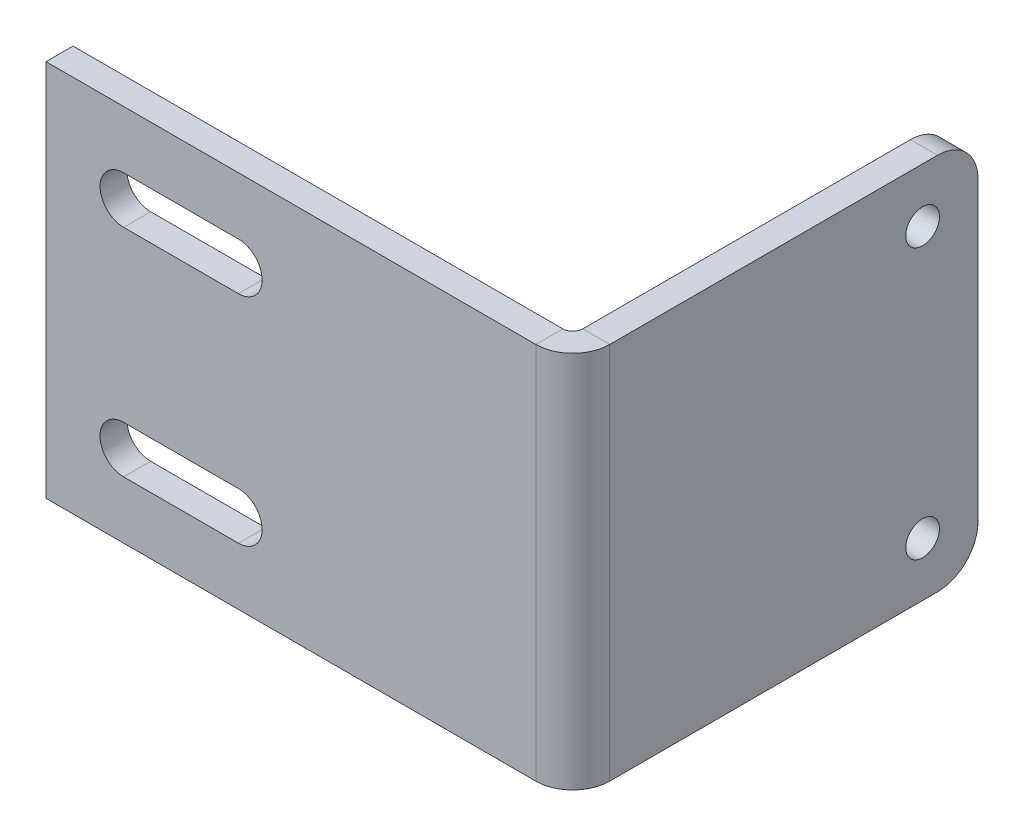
ISO-10303-21;
HEADER;
FILE_DESCRIPTION(('STEP AP214'),'2;1');
FILE_NAME('part.step','',(''),(''),'','','');
FILE_SCHEMA(('AUTOMOTIVE_DESIGN { 1 0 10303 214 1 1 1 1 }'));
ENDSEC;
DATA;
#1=APPLICATION_CONTEXT('core data for automotive mechanical design processes');
#2=APPLICATION_PROTOCOL_DEFINITION('international standard','automotive_design',2000,#1);
#3=PRODUCT_CONTEXT('',#1,'mechanical');
#4=PRODUCT('Part','Part','',(#3));
#5=PRODUCT_RELATED_PRODUCT_CATEGORY('part','',(#4));
#6=PRODUCT_DEFINITION_FORMATION('','',#4);
#7=PRODUCT_DEFINITION_CONTEXT('part definition',#1,'design');
#8=PRODUCT_DEFINITION('design','',#6,#7);
#9=PRODUCT_DEFINITION_SHAPE('','',#8);
#10=(LENGTH_UNIT() NAMED_UNIT(*) SI_UNIT(.MILLI.,.METRE.));
#11=(NAMED_UNIT(*) PLANE_ANGLE_UNIT() SI_UNIT($,.RADIAN.));
#12=(NAMED_UNIT(*) SI_UNIT($,.STERADIAN.) SOLID_ANGLE_UNIT());
#13=UNCERTAINTY_MEASURE_WITH_UNIT(LENGTH_MEASURE(1.E-05),#10,'distance_accuracy_value','');
#14=(GEOMETRIC_REPRESENTATION_CONTEXT(3) GLOBAL_UNCERTAINTY_ASSIGNED_CONTEXT((#13)) GLOBAL_UNIT_ASSIGNED_CONTEXT((#10,
#11,#12)) REPRESENTATION_CONTEXT('',''));
#15=CARTESIAN_POINT('',(0.,0.,0.));
#16=DIRECTION('',(0.,0.,1.));
#17=DIRECTION('',(1.,0.,0.));
#18=AXIS2_PLACEMENT_3D('',#15,#16,#17);
#19=CARTESIAN_POINT('',(0.,0.,2.));
#20=DIRECTION('',(0.,0.,1.));
#21=DIRECTION('',(1.,0.,0.));
#22=AXIS2_PLACEMENT_3D('',#19,#20,#21);
#23=PLANE('',#22);
#24=DIRECTION('',(1.,0.,0.));
#25=VECTOR('',#24,1.);
#26=CARTESIAN_POINT('',(-7.21644966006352E-13,-12.8221643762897,2.));
#27=LINE('',#26,#25);
#28=CARTESIAN_POINT('',(-7.21644966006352E-13,-12.8221643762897,2.));
#29=VERTEX_POINT('',#28);
#30=CARTESIAN_POINT('',(36.2633999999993,-12.8221643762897,2.));
#31=VERTEX_POINT('',#30);
#32=EDGE_CURVE('E255',#29,#31,#27,.T.);
#33=ORIENTED_EDGE('',*,*,#32,.T.);
#34=DIRECTION('',(0.,-1.,0.));
#35=VECTOR('',#34,1.);
#36=CARTESIAN_POINT('',(36.2633999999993,-12.8221643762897,2.));
#37=LINE('',#36,#35);
#38=CARTESIAN_POINT('',(36.2633999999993,15.1778356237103,2.));
#39=VERTEX_POINT('',#38);
#40=EDGE_CURVE('E229',#31,#39,#37,.F.);
#41=ORIENTED_EDGE('',*,*,#40,.T.);
#42=DIRECTION('',(-1.,0.,0.));
#43=VECTOR('',#42,1.);
#44=CARTESIAN_POINT('',(-7.21644966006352E-13,15.1778356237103,2.));
#45=LINE('',#44,#43);
#46=CARTESIAN_POINT('',(-7.21644966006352E-13,15.1778356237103,2.));
#47=VERTEX_POINT('',#46);
#48=EDGE_CURVE('E259',#39,#47,#45,.T.);
#49=ORIENTED_EDGE('',*,*,#48,.T.);
#50=DIRECTION('',(0.,-1.,0.));
#51=VECTOR('',#50,1.);
#52=CARTESIAN_POINT('',(-7.21644966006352E-13,15.1778356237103,2.));
#53=LINE('',#52,#51);
#54=EDGE_CURVE('E252',#47,#29,#53,.T.);
#55=ORIENTED_EDGE('',*,*,#54,.T.);
#56=EDGE_LOOP('',(#33,#41,#49,#55));
#57=FACE_BOUND('',#56,.T.);
#58=CARTESIAN_POINT('',(5.74999999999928,-6.82216437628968,2.));
#59=DIRECTION('',(0.,0.,1.));
#60=DIRECTION('',(1.,0.,0.));
#61=AXIS2_PLACEMENT_3D('',#58,#59,#60);
#62=CIRCLE('',#61,1.75);
#63=CARTESIAN_POINT('',(5.74999999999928,-5.07216437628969,2.));
#64=VERTEX_POINT('',#63);
#65=CARTESIAN_POINT('',(5.74999999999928,-8.57216437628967,2.));
#66=VERTEX_POINT('',#65);
#67=EDGE_CURVE('E180',#64,#66,#62,.T.);
#68=ORIENTED_EDGE('',*,*,#67,.F.);
#69=DIRECTION('',(1.,0.,0.));
#70=VECTOR('',#69,1.);
#71=CARTESIAN_POINT('',(5.74999999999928,-5.07216437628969,2.));
#72=LINE('',#71,#70);
#73=CARTESIAN_POINT('',(14.2499999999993,-5.07216437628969,2.));
#74=VERTEX_POINT('',#73);
#75=EDGE_CURVE('E177',#64,#74,#72,.T.);
#76=ORIENTED_EDGE('',*,*,#75,.T.);
#77=CARTESIAN_POINT('',(14.2499999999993,-6.82216437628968,2.));
#78=DIRECTION('',(0.,0.,1.));
#79=DIRECTION('',(1.,0.,0.));
#80=AXIS2_PLACEMENT_3D('',#77,#78,#79);
#81=CIRCLE('',#80,1.75);
#82=CARTESIAN_POINT('',(14.2499999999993,-8.57216437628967,2.));
#83=VERTEX_POINT('',#82);
#84=EDGE_CURVE('E188',#83,#74,#81,.T.);
#85=ORIENTED_EDGE('',*,*,#84,.F.);
#86=DIRECTION('',(1.,0.,0.));
#87=VECTOR('',#86,1.);
#88=CARTESIAN_POINT('',(5.74999999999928,-8.57216437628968,2.));
#89=LINE('',#88,#87);
#90=EDGE_CURVE('E175',#66,#83,#89,.T.);
#91=ORIENTED_EDGE('',*,*,#90,.F.);
#92=EDGE_LOOP('',(#68,#76,#85,#91));
#93=FACE_BOUND('',#92,.T.);
#94=CARTESIAN_POINT('',(5.74999999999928,9.17783562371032,2.));
#95=DIRECTION('',(0.,0.,1.));
#96=DIRECTION('',(1.,0.,0.));
#97=AXIS2_PLACEMENT_3D('',#94,#95,#96);
#98=CIRCLE('',#97,1.75);
#99=CARTESIAN_POINT('',(5.74999999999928,10.9278356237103,2.));
#100=VERTEX_POINT('',#99);
#101=CARTESIAN_POINT('',(5.74999999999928,7.42783562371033,2.));
#102=VERTEX_POINT('',#101);
#103=EDGE_CURVE('E154',#100,#102,#98,.T.);
#104=ORIENTED_EDGE('',*,*,#103,.F.);
#105=DIRECTION('',(1.,0.,0.));
#106=VECTOR('',#105,1.);
#107=CARTESIAN_POINT('',(5.74999999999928,10.9278356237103,2.));
#108=LINE('',#107,#106);
#109=CARTESIAN_POINT('',(14.2499999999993,10.9278356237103,2.));
#110=VERTEX_POINT('',#109);
#111=EDGE_CURVE('E143',#100,#110,#108,.T.);
#112=ORIENTED_EDGE('',*,*,#111,.T.);
#113=CARTESIAN_POINT('',(14.2499999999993,9.17783562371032,2.));
#114=DIRECTION('',(0.,0.,1.));
#115=DIRECTION('',(1.,0.,0.));
#116=AXIS2_PLACEMENT_3D('',#113,#114,#115);
#117=CIRCLE('',#116,1.75);
#118=CARTESIAN_POINT('',(14.2499999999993,7.42783562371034,2.));
#119=VERTEX_POINT('',#118);
#120=EDGE_CURVE('E163',#119,#110,#117,.T.);
#121=ORIENTED_EDGE('',*,*,#120,.F.);
#122=DIRECTION('',(1.,0.,0.));
#123=VECTOR('',#122,1.);
#124=CARTESIAN_POINT('',(5.74999999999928,7.42783562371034,2.));
#125=LINE('',#124,#123);
#126=EDGE_CURVE('E155',#102,#119,#125,.T.);
#127=ORIENTED_EDGE('',*,*,#126,.F.);
#128=EDGE_LOOP('',(#104,#112,#121,#127));
#129=FACE_BOUND('',#128,.T.);
#130=ADVANCED_FACE('F16',(#57,#93,#129),#23,.T.);
#131=CARTESIAN_POINT('',(-7.21644966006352E-13,-12.8221643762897,2.));
#132=DIRECTION('',(0.,1.,0.));
#133=DIRECTION('',(0.,0.,1.));
#134=AXIS2_PLACEMENT_3D('',#131,#132,#133);
#135=PLANE('',#134);
#136=DIRECTION('',(0.,0.,1.));
#137=VECTOR('',#136,1.);
#138=CARTESIAN_POINT('',(36.2633999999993,-12.8221643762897,0.));
#139=LINE('',#138,#137);
#140=CARTESIAN_POINT('',(36.2633999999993,-12.8221643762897,0.));
#141=VERTEX_POINT('',#140);
#142=EDGE_CURVE('E236',#141,#31,#139,.T.);
#143=ORIENTED_EDGE('',*,*,#142,.T.);
#144=ORIENTED_EDGE('',*,*,#32,.F.);
#145=DIRECTION('',(0.,0.,-1.));
#146=VECTOR('',#145,1.);
#147=CARTESIAN_POINT('',(-7.21644966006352E-13,-12.8221643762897,2.));
#148=LINE('',#147,#146);
#149=CARTESIAN_POINT('',(-7.21644966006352E-13,-12.8221643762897,0.));
#150=VERTEX_POINT('',#149);
#151=EDGE_CURVE('E270',#29,#150,#148,.T.);
#152=ORIENTED_EDGE('',*,*,#151,.T.);
#153=DIRECTION('',(1.,0.,0.));
#154=VECTOR('',#153,1.);
#155=CARTESIAN_POINT('',(-7.21644966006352E-13,-12.8221643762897,0.));
#156=LINE('',#155,#154);
#157=EDGE_CURVE('E264',#150,#141,#156,.T.);
#158=ORIENTED_EDGE('',*,*,#157,.T.);
#159=EDGE_LOOP('',(#143,#144,#152,#158));
#160=FACE_BOUND('',#159,.T.);
#161=ADVANCED_FACE('F353',(#160),#135,.F.);
#162=CARTESIAN_POINT('',(-7.21644966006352E-13,15.1778356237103,2.));
#163=DIRECTION('',(0.,-1.,0.));
#164=DIRECTION('',(0.,0.,-1.));
#165=AXIS2_PLACEMENT_3D('',#162,#163,#164);
#166=PLANE('',#165);
#167=DIRECTION('',(0.,0.,1.));
#168=VECTOR('',#167,1.);
#169=CARTESIAN_POINT('',(36.2633999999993,15.1778356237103,0.));
#170=LINE('',#169,#168);
#171=CARTESIAN_POINT('',(36.2633999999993,15.1778356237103,0.));
#172=VERTEX_POINT('',#171);
#173=EDGE_CURVE('E246',#172,#39,#170,.T.);
#174=ORIENTED_EDGE('',*,*,#173,.F.);
#175=DIRECTION('',(-1.,0.,0.));
#176=VECTOR('',#175,1.);
#177=CARTESIAN_POINT('',(-7.21644966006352E-13,15.1778356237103,0.));
#178=LINE('',#177,#176);
#179=CARTESIAN_POINT('',(-7.21644966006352E-13,15.1778356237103,0.));
#180=VERTEX_POINT('',#179);
#181=EDGE_CURVE('E256',#172,#180,#178,.T.);
#182=ORIENTED_EDGE('',*,*,#181,.T.);
#183=DIRECTION('',(0.,0.,-1.));
#184=VECTOR('',#183,1.);
#185=CARTESIAN_POINT('',(-7.21644966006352E-13,15.1778356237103,2.));
#186=LINE('',#185,#184);
#187=EDGE_CURVE('E261',#47,#180,#186,.T.);
#188=ORIENTED_EDGE('',*,*,#187,.F.);
#189=ORIENTED_EDGE('',*,*,#48,.F.);
#190=EDGE_LOOP('',(#174,#182,#188,#189));
#191=FACE_BOUND('',#190,.T.);
#192=ADVANCED_FACE('F346',(#191),#166,.F.);
#193=CARTESIAN_POINT('',(0.,0.,0.));
#194=DIRECTION('',(0.,0.,1.));
#195=DIRECTION('',(1.,0.,0.));
#196=AXIS2_PLACEMENT_3D('',#193,#194,#195);
#197=PLANE('',#196);
#198=CARTESIAN_POINT('',(14.2499999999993,9.17783562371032,0.));
#199=DIRECTION('',(0.,0.,1.));
#200=DIRECTION('',(1.,0.,0.));
#201=AXIS2_PLACEMENT_3D('',#198,#199,#200);
#202=CIRCLE('',#201,1.75);
#203=CARTESIAN_POINT('',(14.2499999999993,7.42783562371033,0.));
#204=VERTEX_POINT('',#203);
#205=CARTESIAN_POINT('',(14.2499999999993,10.9278356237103,0.));
#206=VERTEX_POINT('',#205);
#207=EDGE_CURVE('E291',#204,#206,#202,.T.);
#208=ORIENTED_EDGE('',*,*,#207,.T.);
#209=DIRECTION('',(-1.,0.,0.));
#210=VECTOR('',#209,1.);
#211=CARTESIAN_POINT('',(0.,10.9278356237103,0.));
#212=LINE('',#211,#210);
#213=CARTESIAN_POINT('',(5.74999999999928,10.9278356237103,0.));
#214=VERTEX_POINT('',#213);
#215=EDGE_CURVE('E294',#206,#214,#212,.T.);
#216=ORIENTED_EDGE('',*,*,#215,.T.);
#217=CARTESIAN_POINT('',(5.74999999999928,9.17783562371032,0.));
#218=DIRECTION('',(0.,0.,1.));
#219=DIRECTION('',(1.,0.,0.));
#220=AXIS2_PLACEMENT_3D('',#217,#218,#219);
#221=CIRCLE('',#220,1.75);
#222=CARTESIAN_POINT('',(5.74999999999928,7.42783562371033,0.));
#223=VERTEX_POINT('',#222);
#224=EDGE_CURVE('E162',#214,#223,#221,.T.);
#225=ORIENTED_EDGE('',*,*,#224,.T.);
#226=DIRECTION('',(1.,0.,0.));
#227=VECTOR('',#226,1.);
#228=CARTESIAN_POINT('',(0.,7.42783562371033,0.));
#229=LINE('',#228,#227);
#230=EDGE_CURVE('E287',#223,#204,#229,.T.);
#231=ORIENTED_EDGE('',*,*,#230,.T.);
#232=EDGE_LOOP('',(#208,#216,#225,#231));
#233=FACE_BOUND('',#232,.T.);
#234=CARTESIAN_POINT('',(14.2499999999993,-6.82216437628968,0.));
#235=DIRECTION('',(0.,0.,1.));
#236=DIRECTION('',(1.,0.,0.));
#237=AXIS2_PLACEMENT_3D('',#234,#235,#236);
#238=CIRCLE('',#237,1.75);
#239=CARTESIAN_POINT('',(14.2499999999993,-8.57216437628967,0.));
#240=VERTEX_POINT('',#239);
#241=CARTESIAN_POINT('',(14.2499999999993,-5.07216437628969,0.));
#242=VERTEX_POINT('',#241);
#243=EDGE_CURVE('E281',#240,#242,#238,.T.);
#244=ORIENTED_EDGE('',*,*,#243,.T.);
#245=DIRECTION('',(-1.,0.,0.));
#246=VECTOR('',#245,1.);
#247=CARTESIAN_POINT('',(0.,-5.07216437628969,0.));
#248=LINE('',#247,#246);
#249=CARTESIAN_POINT('',(5.74999999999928,-5.07216437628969,0.));
#250=VERTEX_POINT('',#249);
#251=EDGE_CURVE('E284',#242,#250,#248,.T.);
#252=ORIENTED_EDGE('',*,*,#251,.T.);
#253=CARTESIAN_POINT('',(5.74999999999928,-6.82216437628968,0.));
#254=DIRECTION('',(0.,0.,1.));
#255=DIRECTION('',(1.,0.,0.));
#256=AXIS2_PLACEMENT_3D('',#253,#254,#255);
#257=CIRCLE('',#256,1.75);
#258=CARTESIAN_POINT('',(5.74999999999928,-8.57216437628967,0.));
#259=VERTEX_POINT('',#258);
#260=EDGE_CURVE('E278',#250,#259,#257,.T.);
#261=ORIENTED_EDGE('',*,*,#260,.T.);
#262=DIRECTION('',(1.,0.,0.));
#263=VECTOR('',#262,1.);
#264=CARTESIAN_POINT('',(0.,-8.57216437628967,0.));
#265=LINE('',#264,#263);
#266=EDGE_CURVE('E273',#259,#240,#265,.T.);
#267=ORIENTED_EDGE('',*,*,#266,.T.);
#268=EDGE_LOOP('',(#244,#252,#261,#267));
#269=FACE_BOUND('',#268,.T.);
#270=DIRECTION('',(0.,-1.,0.));
#271=VECTOR('',#270,1.);
#272=CARTESIAN_POINT('',(36.2633999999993,-12.8221643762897,0.));
#273=LINE('',#272,#271);
#274=EDGE_CURVE('E242',#141,#172,#273,.F.);
#275=ORIENTED_EDGE('',*,*,#274,.F.);
#276=ORIENTED_EDGE('',*,*,#157,.F.);
#277=DIRECTION('',(0.,-1.,0.));
#278=VECTOR('',#277,1.);
#279=CARTESIAN_POINT('',(-7.21644966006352E-13,15.1778356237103,0.));
#280=LINE('',#279,#278);
#281=EDGE_CURVE('E249',#180,#150,#280,.T.);
#282=ORIENTED_EDGE('',*,*,#281,.F.);
#283=ORIENTED_EDGE('',*,*,#181,.F.);
#284=EDGE_LOOP('',(#275,#276,#282,#283));
#285=FACE_BOUND('',#284,.T.);
#286=ADVANCED_FACE('F358',(#233,#269,#285),#197,.F.);
#287=CARTESIAN_POINT('',(-7.21644966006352E-13,15.1778356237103,2.));
#288=DIRECTION('',(1.,0.,0.));
#289=DIRECTION('',(0.,0.,-1.));
#290=AXIS2_PLACEMENT_3D('',#287,#288,#289);
#291=PLANE('',#290);
#292=ORIENTED_EDGE('',*,*,#281,.T.);
#293=ORIENTED_EDGE('',*,*,#151,.F.);
#294=ORIENTED_EDGE('',*,*,#54,.F.);
#295=ORIENTED_EDGE('',*,*,#187,.T.);
#296=EDGE_LOOP('',(#292,#293,#294,#295));
#297=FACE_BOUND('',#296,.T.);
#298=ADVANCED_FACE('F351',(#297),#291,.F.);
#299=CARTESIAN_POINT('',(36.2633999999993,15.1778356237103,-0.7366));
#300=DIRECTION('',(0.,1.,0.));
#301=DIRECTION('',(0.,0.,1.));
#302=AXIS2_PLACEMENT_3D('',#299,#300,#301);
#303=PLANE('',#302);
#304=DIRECTION('',(-1.,0.,0.));
#305=VECTOR('',#304,1.);
#306=CARTESIAN_POINT('',(38.9999999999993,15.1778356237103,-0.73659999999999));
#307=LINE('',#306,#305);
#308=CARTESIAN_POINT('',(36.9999999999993,15.1778356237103,-0.7366));
#309=VERTEX_POINT('',#308);
#310=CARTESIAN_POINT('',(38.9999999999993,15.1778356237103,-0.73659999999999));
#311=VERTEX_POINT('',#310);
#312=EDGE_CURVE('E205',#309,#311,#307,.F.);
#313=ORIENTED_EDGE('',*,*,#312,.F.);
#314=CARTESIAN_POINT('',(36.2633999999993,15.1778356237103,-0.7366));
#315=DIRECTION('',(0.,-1.,0.));
#316=DIRECTION('',(0.,0.,-1.));
#317=AXIS2_PLACEMENT_3D('',#314,#315,#316);
#318=CIRCLE('',#317,0.7366);
#319=EDGE_CURVE('E239',#172,#309,#318,.F.);
#320=ORIENTED_EDGE('',*,*,#319,.F.);
#321=ORIENTED_EDGE('',*,*,#173,.T.);
#322=CARTESIAN_POINT('',(36.2633999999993,15.1778356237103,-0.7366));
#323=DIRECTION('',(0.,-1.,0.));
#324=DIRECTION('',(0.,0.,-1.));
#325=AXIS2_PLACEMENT_3D('',#322,#323,#324);
#326=CIRCLE('',#325,2.7366);
#327=EDGE_CURVE('E232',#39,#311,#326,.F.);
#328=ORIENTED_EDGE('',*,*,#327,.T.);
#329=EDGE_LOOP('',(#313,#320,#321,#328));
#330=FACE_BOUND('',#329,.T.);
#331=ADVANCED_FACE('F337',(#330),#303,.T.);
#332=CARTESIAN_POINT('',(36.2633999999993,-12.8221643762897,-0.7366));
#333=DIRECTION('',(0.,1.,0.));
#334=DIRECTION('',(0.,0.,1.));
#335=AXIS2_PLACEMENT_3D('',#332,#333,#334);
#336=PLANE('',#335);
#337=CARTESIAN_POINT('',(36.2633999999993,-12.8221643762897,-0.7366));
#338=DIRECTION('',(0.,-1.,0.));
#339=DIRECTION('',(0.,0.,-1.));
#340=AXIS2_PLACEMENT_3D('',#337,#338,#339);
#341=CIRCLE('',#340,0.7366);
#342=CARTESIAN_POINT('',(36.9999999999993,-12.8221643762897,-0.7366));
#343=VERTEX_POINT('',#342);
#344=EDGE_CURVE('E208',#343,#141,#341,.T.);
#345=ORIENTED_EDGE('',*,*,#344,.F.);
#346=DIRECTION('',(-1.,0.,0.));
#347=VECTOR('',#346,1.);
#348=CARTESIAN_POINT('',(36.9999999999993,-12.8221643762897,-0.7366));
#349=LINE('',#348,#347);
#350=CARTESIAN_POINT('',(38.9999999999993,-12.8221643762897,-0.73659999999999));
#351=VERTEX_POINT('',#350);
#352=EDGE_CURVE('E222',#343,#351,#349,.F.);
#353=ORIENTED_EDGE('',*,*,#352,.T.);
#354=CARTESIAN_POINT('',(36.2633999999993,-12.8221643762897,-0.7366));
#355=DIRECTION('',(0.,-1.,0.));
#356=DIRECTION('',(0.,0.,-1.));
#357=AXIS2_PLACEMENT_3D('',#354,#355,#356);
#358=CIRCLE('',#357,2.7366);
#359=EDGE_CURVE('E233',#351,#31,#358,.T.);
#360=ORIENTED_EDGE('',*,*,#359,.T.);
#361=ORIENTED_EDGE('',*,*,#142,.F.);
#362=EDGE_LOOP('',(#345,#353,#360,#361));
#363=FACE_BOUND('',#362,.T.);
#364=ADVANCED_FACE('F333',(#363),#336,.F.);
#365=CARTESIAN_POINT('',(36.2633999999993,-12.8221643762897,-0.7366));
#366=DIRECTION('',(0.,-1.,0.));
#367=DIRECTION('',(1.,0.,0.));
#368=AXIS2_PLACEMENT_3D('',#365,#366,#367);
#369=CYLINDRICAL_SURFACE('',#368,2.7366);
#370=ORIENTED_EDGE('',*,*,#40,.F.);
#371=ORIENTED_EDGE('',*,*,#359,.F.);
#372=DIRECTION('',(0.,-1.,0.));
#373=VECTOR('',#372,1.);
#374=CARTESIAN_POINT('',(38.9999999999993,15.1778356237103,-0.73659999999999));
#375=LINE('',#374,#373);
#376=EDGE_CURVE('E219',#351,#311,#375,.F.);
#377=ORIENTED_EDGE('',*,*,#376,.T.);
#378=ORIENTED_EDGE('',*,*,#327,.F.);
#379=EDGE_LOOP('',(#370,#371,#377,#378));
#380=FACE_BOUND('',#379,.T.);
#381=ADVANCED_FACE('F335',(#380),#369,.T.);
#382=CARTESIAN_POINT('',(36.2633999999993,-12.8221643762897,-0.7366));
#383=DIRECTION('',(0.,-1.,0.));
#384=DIRECTION('',(1.,0.,0.));
#385=AXIS2_PLACEMENT_3D('',#382,#383,#384);
#386=CYLINDRICAL_SURFACE('',#385,0.7366);
#387=ORIENTED_EDGE('',*,*,#274,.T.);
#388=ORIENTED_EDGE('',*,*,#319,.T.);
#389=DIRECTION('',(0.,-1.,0.));
#390=VECTOR('',#389,1.);
#391=CARTESIAN_POINT('',(36.9999999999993,15.1778356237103,-0.7366));
#392=LINE('',#391,#390);
#393=EDGE_CURVE('E225',#309,#343,#392,.T.);
#394=ORIENTED_EDGE('',*,*,#393,.T.);
#395=ORIENTED_EDGE('',*,*,#344,.T.);
#396=EDGE_LOOP('',(#387,#388,#394,#395));
#397=FACE_BOUND('',#396,.T.);
#398=ADVANCED_FACE('F356',(#397),#386,.F.);
#399=CARTESIAN_POINT('',(38.9999999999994,-12.8221643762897,-28.));
#400=DIRECTION('',(0.,1.,0.));
#401=DIRECTION('',(0.,0.,1.));
#402=AXIS2_PLACEMENT_3D('',#399,#400,#401);
#403=PLANE('',#402);
#404=DIRECTION('',(0.,0.,1.));
#405=VECTOR('',#404,1.);
#406=CARTESIAN_POINT('',(36.9999999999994,-12.8221643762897,-28.));
#407=LINE('',#406,#405);
#408=CARTESIAN_POINT('',(36.9999999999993,-12.8221643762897,-25.));
#409=VERTEX_POINT('',#408);
#410=EDGE_CURVE('E217',#343,#409,#407,.F.);
#411=ORIENTED_EDGE('',*,*,#410,.T.);
#412=DIRECTION('',(-1.,0.,0.));
#413=VECTOR('',#412,1.);
#414=CARTESIAN_POINT('',(38.9999999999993,-12.8221643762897,-25.));
#415=LINE('',#414,#413);
#416=CARTESIAN_POINT('',(38.9999999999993,-12.8221643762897,-25.));
#417=VERTEX_POINT('',#416);
#418=EDGE_CURVE('E11',#409,#417,#415,.F.);
#419=ORIENTED_EDGE('',*,*,#418,.T.);
#420=DIRECTION('',(0.,0.,-1.));
#421=VECTOR('',#420,1.);
#422=CARTESIAN_POINT('',(38.9999999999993,-12.8221643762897,1.42291393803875E-13));
#423=LINE('',#422,#421);
#424=EDGE_CURVE('E211',#351,#417,#423,.T.);
#425=ORIENTED_EDGE('',*,*,#424,.F.);
#426=ORIENTED_EDGE('',*,*,#352,.F.);
#427=EDGE_LOOP('',(#411,#419,#425,#426));
#428=FACE_BOUND('',#427,.T.);
#429=ADVANCED_FACE('F330',(#428),#403,.F.);
#430=CARTESIAN_POINT('',(38.9999999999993,15.1778356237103,0.));
#431=DIRECTION('',(0.,-1.,0.));
#432=DIRECTION('',(0.,0.,-1.));
#433=AXIS2_PLACEMENT_3D('',#430,#431,#432);
#434=PLANE('',#433);
#435=DIRECTION('',(0.,0.,1.));
#436=VECTOR('',#435,1.);
#437=CARTESIAN_POINT('',(38.9999999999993,15.1778356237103,1.42291393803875E-13));
#438=LINE('',#437,#436);
#439=CARTESIAN_POINT('',(38.9999999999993,15.1778356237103,-25.));
#440=VERTEX_POINT('',#439);
#441=EDGE_CURVE('E206',#440,#311,#438,.T.);
#442=ORIENTED_EDGE('',*,*,#441,.F.);
#443=DIRECTION('',(-1.,0.,0.));
#444=VECTOR('',#443,1.);
#445=CARTESIAN_POINT('',(38.9999999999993,15.1778356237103,-25.));
#446=LINE('',#445,#444);
#447=CARTESIAN_POINT('',(36.9999999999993,15.1778356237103,-25.));
#448=VERTEX_POINT('',#447);
#449=EDGE_CURVE('E296',#440,#448,#446,.T.);
#450=ORIENTED_EDGE('',*,*,#449,.T.);
#451=DIRECTION('',(0.,0.,-1.));
#452=VECTOR('',#451,1.);
#453=CARTESIAN_POINT('',(36.9999999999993,15.1778356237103,0.));
#454=LINE('',#453,#452);
#455=EDGE_CURVE('E213',#448,#309,#454,.F.);
#456=ORIENTED_EDGE('',*,*,#455,.T.);
#457=ORIENTED_EDGE('',*,*,#312,.T.);
#458=EDGE_LOOP('',(#442,#450,#456,#457));
#459=FACE_BOUND('',#458,.T.);
#460=ADVANCED_FACE('F316',(#459),#434,.F.);
#461=CARTESIAN_POINT('',(38.9999999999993,0.,1.42291393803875E-13));
#462=DIRECTION('',(-1.,0.,0.));
#463=DIRECTION('',(0.,0.,1.));
#464=AXIS2_PLACEMENT_3D('',#461,#462,#463);
#465=PLANE('',#464);
#466=CARTESIAN_POINT('',(38.9999999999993,-8.82216437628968,-23.9));
#467=DIRECTION('',(1.,0.,0.));
#468=DIRECTION('',(0.,0.,-1.));
#469=AXIS2_PLACEMENT_3D('',#466,#467,#468);
#470=CIRCLE('',#469,1.24999999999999);
#471=CARTESIAN_POINT('',(38.9999999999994,-8.82216437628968,-25.15));
#472=VERTEX_POINT('',#471);
#473=EDGE_CURVE('E195',#472,#472,#470,.T.);
#474=ORIENTED_EDGE('',*,*,#473,.F.);
#475=EDGE_LOOP('',(#474));
#476=FACE_BOUND('',#475,.T.);
#477=CARTESIAN_POINT('',(38.9999999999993,11.1778356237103,-23.9));
#478=DIRECTION('',(1.,0.,0.));
#479=DIRECTION('',(0.,0.,-1.));
#480=AXIS2_PLACEMENT_3D('',#477,#478,#479);
#481=CIRCLE('',#480,1.24999999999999);
#482=CARTESIAN_POINT('',(38.9999999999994,11.1778356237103,-25.15));
#483=VERTEX_POINT('',#482);
#484=EDGE_CURVE('E199',#483,#483,#481,.T.);
#485=ORIENTED_EDGE('',*,*,#484,.F.);
#486=EDGE_LOOP('',(#485));
#487=FACE_BOUND('',#486,.T.);
#488=DIRECTION('',(0.,1.,0.));
#489=VECTOR('',#488,1.);
#490=CARTESIAN_POINT('',(38.9999999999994,0.,-28.));
#491=LINE('',#490,#489);
#492=CARTESIAN_POINT('',(38.9999999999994,-9.82216437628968,-28.));
#493=VERTEX_POINT('',#492);
#494=CARTESIAN_POINT('',(38.9999999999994,12.1778356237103,-28.));
#495=VERTEX_POINT('',#494);
#496=EDGE_CURVE('E209',#493,#495,#491,.T.);
#497=ORIENTED_EDGE('',*,*,#496,.T.);
#498=CARTESIAN_POINT('',(38.9999999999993,12.1778356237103,-25.));
#499=DIRECTION('',(-1.,0.,0.));
#500=DIRECTION('',(0.,0.,1.));
#501=AXIS2_PLACEMENT_3D('',#498,#499,#500);
#502=CIRCLE('',#501,3.);
#503=EDGE_CURVE('E24',#495,#440,#502,.F.);
#504=ORIENTED_EDGE('',*,*,#503,.T.);
#505=ORIENTED_EDGE('',*,*,#441,.T.);
#506=ORIENTED_EDGE('',*,*,#376,.F.);
#507=ORIENTED_EDGE('',*,*,#424,.T.);
#508=CARTESIAN_POINT('',(38.9999999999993,-9.82216437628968,-25.));
#509=DIRECTION('',(-1.,0.,0.));
#510=DIRECTION('',(0.,0.,1.));
#511=AXIS2_PLACEMENT_3D('',#508,#509,#510);
#512=CIRCLE('',#511,3.);
#513=EDGE_CURVE('E307',#417,#493,#512,.F.);
#514=ORIENTED_EDGE('',*,*,#513,.T.);
#515=EDGE_LOOP('',(#497,#504,#505,#506,#507,#514));
#516=FACE_BOUND('',#515,.T.);
#517=ADVANCED_FACE('F311',(#476,#487,#516),#465,.F.);
#518=CARTESIAN_POINT('',(36.9999999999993,0.,1.35308431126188E-13));
#519=DIRECTION('',(-1.,0.,0.));
#520=DIRECTION('',(0.,0.,1.));
#521=AXIS2_PLACEMENT_3D('',#518,#519,#520);
#522=PLANE('',#521);
#523=CARTESIAN_POINT('',(36.9999999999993,-8.82216437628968,-23.9));
#524=DIRECTION('',(-1.,0.,0.));
#525=DIRECTION('',(0.,0.,1.));
#526=AXIS2_PLACEMENT_3D('',#523,#524,#525);
#527=CIRCLE('',#526,1.25);
#528=CARTESIAN_POINT('',(36.9999999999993,-8.82216437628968,-22.65));
#529=VERTEX_POINT('',#528);
#530=EDGE_CURVE('E198',#529,#529,#527,.T.);
#531=ORIENTED_EDGE('',*,*,#530,.F.);
#532=EDGE_LOOP('',(#531));
#533=FACE_BOUND('',#532,.T.);
#534=CARTESIAN_POINT('',(36.9999999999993,11.1778356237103,-23.9));
#535=DIRECTION('',(-1.,0.,0.));
#536=DIRECTION('',(0.,0.,1.));
#537=AXIS2_PLACEMENT_3D('',#534,#535,#536);
#538=CIRCLE('',#537,1.25);
#539=CARTESIAN_POINT('',(36.9999999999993,11.1778356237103,-22.65));
#540=VERTEX_POINT('',#539);
#541=EDGE_CURVE('E202',#540,#540,#538,.T.);
#542=ORIENTED_EDGE('',*,*,#541,.F.);
#543=EDGE_LOOP('',(#542));
#544=FACE_BOUND('',#543,.T.);
#545=ORIENTED_EDGE('',*,*,#455,.F.);
#546=CARTESIAN_POINT('',(36.9999999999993,12.1778356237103,-25.));
#547=DIRECTION('',(-1.,0.,0.));
#548=DIRECTION('',(0.,0.,1.));
#549=AXIS2_PLACEMENT_3D('',#546,#547,#548);
#550=CIRCLE('',#549,3.);
#551=CARTESIAN_POINT('',(36.9999999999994,12.1778356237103,-28.));
#552=VERTEX_POINT('',#551);
#553=EDGE_CURVE('E301',#448,#552,#550,.T.);
#554=ORIENTED_EDGE('',*,*,#553,.T.);
#555=DIRECTION('',(0.,-1.,0.));
#556=VECTOR('',#555,1.);
#557=CARTESIAN_POINT('',(36.9999999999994,15.1778356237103,-28.));
#558=LINE('',#557,#556);
#559=CARTESIAN_POINT('',(36.9999999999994,-9.82216437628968,-28.));
#560=VERTEX_POINT('',#559);
#561=EDGE_CURVE('E215',#560,#552,#558,.F.);
#562=ORIENTED_EDGE('',*,*,#561,.F.);
#563=CARTESIAN_POINT('',(36.9999999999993,-9.82216437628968,-25.));
#564=DIRECTION('',(-1.,0.,0.));
#565=DIRECTION('',(0.,0.,1.));
#566=AXIS2_PLACEMENT_3D('',#563,#564,#565);
#567=CIRCLE('',#566,3.);
#568=EDGE_CURVE('E299',#560,#409,#567,.T.);
#569=ORIENTED_EDGE('',*,*,#568,.T.);
#570=ORIENTED_EDGE('',*,*,#410,.F.);
#571=ORIENTED_EDGE('',*,*,#393,.F.);
#572=EDGE_LOOP('',(#545,#554,#562,#569,#570,#571));
#573=FACE_BOUND('',#572,.T.);
#574=ADVANCED_FACE('F322',(#533,#544,#573),#522,.T.);
#575=CARTESIAN_POINT('',(38.9999999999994,15.1778356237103,-28.));
#576=DIRECTION('',(0.,0.,1.));
#577=DIRECTION('',(1.,0.,0.));
#578=AXIS2_PLACEMENT_3D('',#575,#576,#577);
#579=PLANE('',#578);
#580=ORIENTED_EDGE('',*,*,#561,.T.);
#581=DIRECTION('',(-1.,0.,0.));
#582=VECTOR('',#581,1.);
#583=CARTESIAN_POINT('',(38.9999999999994,12.1778356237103,-28.));
#584=LINE('',#583,#582);
#585=EDGE_CURVE('E37',#552,#495,#584,.F.);
#586=ORIENTED_EDGE('',*,*,#585,.T.);
#587=ORIENTED_EDGE('',*,*,#496,.F.);
#588=DIRECTION('',(-1.,0.,0.));
#589=VECTOR('',#588,1.);
#590=CARTESIAN_POINT('',(38.9999999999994,-9.82216437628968,-28.));
#591=LINE('',#590,#589);
#592=EDGE_CURVE('E303',#493,#560,#591,.T.);
#593=ORIENTED_EDGE('',*,*,#592,.T.);
#594=EDGE_LOOP('',(#580,#586,#587,#593));
#595=FACE_BOUND('',#594,.T.);
#596=ADVANCED_FACE('F324',(#595),#579,.F.);
#597=CARTESIAN_POINT('',(38.9999999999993,11.1778356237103,-23.9));
#598=DIRECTION('',(1.,0.,0.));
#599=DIRECTION('',(0.,0.,-1.));
#600=AXIS2_PLACEMENT_3D('',#597,#598,#599);
#601=CYLINDRICAL_SURFACE('',#600,1.25);
#602=ORIENTED_EDGE('',*,*,#541,.T.);
#603=EDGE_LOOP('',(#602));
#604=FACE_BOUND('',#603,.T.);
#605=ORIENTED_EDGE('',*,*,#484,.T.);
#606=EDGE_LOOP('',(#605));
#607=FACE_BOUND('',#606,.T.);
#608=ADVANCED_FACE('F391',(#604,#607),#601,.F.);
#609=CARTESIAN_POINT('',(38.9999999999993,-8.82216437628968,-23.9));
#610=DIRECTION('',(1.,0.,0.));
#611=DIRECTION('',(0.,0.,-1.));
#612=AXIS2_PLACEMENT_3D('',#609,#610,#611);
#613=CYLINDRICAL_SURFACE('',#612,1.25);
#614=ORIENTED_EDGE('',*,*,#530,.T.);
#615=EDGE_LOOP('',(#614));
#616=FACE_BOUND('',#615,.T.);
#617=ORIENTED_EDGE('',*,*,#473,.T.);
#618=EDGE_LOOP('',(#617));
#619=FACE_BOUND('',#618,.T.);
#620=ADVANCED_FACE('F402',(#616,#619),#613,.F.);
#621=CARTESIAN_POINT('',(14.2499999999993,-6.82216437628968,2.));
#622=DIRECTION('',(0.,0.,1.));
#623=DIRECTION('',(1.,0.,0.));
#624=AXIS2_PLACEMENT_3D('',#621,#622,#623);
#625=CYLINDRICAL_SURFACE('',#624,1.75);
#626=DIRECTION('',(0.,0.,1.));
#627=VECTOR('',#626,1.);
#628=CARTESIAN_POINT('',(14.2499999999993,-8.57216437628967,2.));
#629=LINE('',#628,#627);
#630=EDGE_CURVE('E193',#83,#240,#629,.F.);
#631=ORIENTED_EDGE('',*,*,#630,.F.);
#632=ORIENTED_EDGE('',*,*,#84,.T.);
#633=DIRECTION('',(0.,0.,1.));
#634=VECTOR('',#633,1.);
#635=CARTESIAN_POINT('',(14.2499999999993,-5.07216437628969,2.));
#636=LINE('',#635,#634);
#637=EDGE_CURVE('E191',#242,#74,#636,.T.);
#638=ORIENTED_EDGE('',*,*,#637,.F.);
#639=ORIENTED_EDGE('',*,*,#243,.F.);
#640=EDGE_LOOP('',(#631,#632,#638,#639));
#641=FACE_BOUND('',#640,.T.);
#642=ADVANCED_FACE('F406',(#641),#625,.F.);
#643=CARTESIAN_POINT('',(5.74999999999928,-6.82216437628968,2.));
#644=DIRECTION('',(0.,0.,1.));
#645=DIRECTION('',(1.,0.,0.));
#646=AXIS2_PLACEMENT_3D('',#643,#644,#645);
#647=CYLINDRICAL_SURFACE('',#646,1.75);
#648=DIRECTION('',(0.,0.,1.));
#649=VECTOR('',#648,1.);
#650=CARTESIAN_POINT('',(5.74999999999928,-5.07216437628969,2.));
#651=LINE('',#650,#649);
#652=EDGE_CURVE('E185',#64,#250,#651,.F.);
#653=ORIENTED_EDGE('',*,*,#652,.F.);
#654=ORIENTED_EDGE('',*,*,#67,.T.);
#655=DIRECTION('',(0.,0.,1.));
#656=VECTOR('',#655,1.);
#657=CARTESIAN_POINT('',(5.74999999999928,-8.57216437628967,2.));
#658=LINE('',#657,#656);
#659=EDGE_CURVE('E182',#259,#66,#658,.T.);
#660=ORIENTED_EDGE('',*,*,#659,.F.);
#661=ORIENTED_EDGE('',*,*,#260,.F.);
#662=EDGE_LOOP('',(#653,#654,#660,#661));
#663=FACE_BOUND('',#662,.T.);
#664=ADVANCED_FACE('F410',(#663),#647,.F.);
#665=CARTESIAN_POINT('',(5.74999999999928,-5.07216437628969,2.));
#666=DIRECTION('',(0.,1.,0.));
#667=DIRECTION('',(-1.,0.,0.));
#668=AXIS2_PLACEMENT_3D('',#665,#666,#667);
#669=PLANE('',#668);
#670=ORIENTED_EDGE('',*,*,#637,.T.);
#671=ORIENTED_EDGE('',*,*,#75,.F.);
#672=ORIENTED_EDGE('',*,*,#652,.T.);
#673=ORIENTED_EDGE('',*,*,#251,.F.);
#674=EDGE_LOOP('',(#670,#671,#672,#673));
#675=FACE_BOUND('',#674,.T.);
#676=ADVANCED_FACE('F414',(#675),#669,.F.);
#677=CARTESIAN_POINT('',(5.74999999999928,-8.57216437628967,2.));
#678=DIRECTION('',(0.,-1.,0.));
#679=DIRECTION('',(1.,0.,0.));
#680=AXIS2_PLACEMENT_3D('',#677,#678,#679);
#681=PLANE('',#680);
#682=ORIENTED_EDGE('',*,*,#659,.T.);
#683=ORIENTED_EDGE('',*,*,#90,.T.);
#684=ORIENTED_EDGE('',*,*,#630,.T.);
#685=ORIENTED_EDGE('',*,*,#266,.F.);
#686=EDGE_LOOP('',(#682,#683,#684,#685));
#687=FACE_BOUND('',#686,.T.);
#688=ADVANCED_FACE('F418',(#687),#681,.F.);
#689=CARTESIAN_POINT('',(5.74999999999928,10.9278356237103,2.));
#690=DIRECTION('',(0.,1.,0.));
#691=DIRECTION('',(0.,0.,1.));
#692=AXIS2_PLACEMENT_3D('',#689,#690,#691);
#693=PLANE('',#692);
#694=DIRECTION('',(0.,0.,1.));
#695=VECTOR('',#694,1.);
#696=CARTESIAN_POINT('',(14.2499999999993,10.9278356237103,2.));
#697=LINE('',#696,#695);
#698=EDGE_CURVE('E149',#206,#110,#697,.T.);
#699=ORIENTED_EDGE('',*,*,#698,.T.);
#700=ORIENTED_EDGE('',*,*,#111,.F.);
#701=DIRECTION('',(0.,0.,1.));
#702=VECTOR('',#701,1.);
#703=CARTESIAN_POINT('',(5.74999999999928,10.9278356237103,2.));
#704=LINE('',#703,#702);
#705=EDGE_CURVE('E146',#100,#214,#704,.F.);
#706=ORIENTED_EDGE('',*,*,#705,.T.);
#707=ORIENTED_EDGE('',*,*,#215,.F.);
#708=EDGE_LOOP('',(#699,#700,#706,#707));
#709=FACE_BOUND('',#708,.T.);
#710=ADVANCED_FACE('F145',(#709),#693,.F.);
#711=CARTESIAN_POINT('',(14.2499999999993,9.17783562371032,2.));
#712=DIRECTION('',(0.,0.,1.));
#713=DIRECTION('',(1.,0.,0.));
#714=AXIS2_PLACEMENT_3D('',#711,#712,#713);
#715=CYLINDRICAL_SURFACE('',#714,1.75);
#716=DIRECTION('',(0.,0.,1.));
#717=VECTOR('',#716,1.);
#718=CARTESIAN_POINT('',(14.2499999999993,7.42783562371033,2.));
#719=LINE('',#718,#717);
#720=EDGE_CURVE('E173',#119,#204,#719,.F.);
#721=ORIENTED_EDGE('',*,*,#720,.F.);
#722=ORIENTED_EDGE('',*,*,#120,.T.);
#723=ORIENTED_EDGE('',*,*,#698,.F.);
#724=ORIENTED_EDGE('',*,*,#207,.F.);
#725=EDGE_LOOP('',(#721,#722,#723,#724));
#726=FACE_BOUND('',#725,.T.);
#727=ADVANCED_FACE('F423',(#726),#715,.F.);
#728=CARTESIAN_POINT('',(5.74999999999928,9.17783562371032,2.));
#729=DIRECTION('',(0.,0.,1.));
#730=DIRECTION('',(1.,0.,0.));
#731=AXIS2_PLACEMENT_3D('',#728,#729,#730);
#732=CYLINDRICAL_SURFACE('',#731,1.75);
#733=ORIENTED_EDGE('',*,*,#705,.F.);
#734=ORIENTED_EDGE('',*,*,#103,.T.);
#735=DIRECTION('',(0.,0.,1.));
#736=VECTOR('',#735,1.);
#737=CARTESIAN_POINT('',(5.74999999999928,7.42783562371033,2.));
#738=LINE('',#737,#736);
#739=EDGE_CURVE('E164',#223,#102,#738,.T.);
#740=ORIENTED_EDGE('',*,*,#739,.F.);
#741=ORIENTED_EDGE('',*,*,#224,.F.);
#742=EDGE_LOOP('',(#733,#734,#740,#741));
#743=FACE_BOUND('',#742,.T.);
#744=ADVANCED_FACE('F158',(#743),#732,.F.);
#745=CARTESIAN_POINT('',(5.74999999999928,7.42783562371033,2.));
#746=DIRECTION('',(0.,-1.,0.));
#747=DIRECTION('',(0.,0.,-1.));
#748=AXIS2_PLACEMENT_3D('',#745,#746,#747);
#749=PLANE('',#748);
#750=ORIENTED_EDGE('',*,*,#739,.T.);
#751=ORIENTED_EDGE('',*,*,#126,.T.);
#752=ORIENTED_EDGE('',*,*,#720,.T.);
#753=ORIENTED_EDGE('',*,*,#230,.F.);
#754=EDGE_LOOP('',(#750,#751,#752,#753));
#755=FACE_BOUND('',#754,.T.);
#756=ADVANCED_FACE('F429',(#755),#749,.F.);
#757=CARTESIAN_POINT('',(38.9999999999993,12.1778356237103,-25.));
#758=DIRECTION('',(-1.,0.,0.));
#759=DIRECTION('',(0.,0.,1.));
#760=AXIS2_PLACEMENT_3D('',#757,#758,#759);
#761=CYLINDRICAL_SURFACE('',#760,3.);
#762=ORIENTED_EDGE('',*,*,#503,.F.);
#763=ORIENTED_EDGE('',*,*,#585,.F.);
#764=ORIENTED_EDGE('',*,*,#553,.F.);
#765=ORIENTED_EDGE('',*,*,#449,.F.);
#766=EDGE_LOOP('',(#762,#763,#764,#765));
#767=FACE_BOUND('',#766,.T.);
#768=ADVANCED_FACE('F319',(#767),#761,.T.);
#769=CARTESIAN_POINT('',(38.9999999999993,-9.82216437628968,-25.));
#770=DIRECTION('',(-1.,0.,0.));
#771=DIRECTION('',(0.,0.,1.));
#772=AXIS2_PLACEMENT_3D('',#769,#770,#771);
#773=CYLINDRICAL_SURFACE('',#772,3.);
#774=ORIENTED_EDGE('',*,*,#513,.F.);
#775=ORIENTED_EDGE('',*,*,#418,.F.);
#776=ORIENTED_EDGE('',*,*,#568,.F.);
#777=ORIENTED_EDGE('',*,*,#592,.F.);
#778=EDGE_LOOP('',(#774,#775,#776,#777));
#779=FACE_BOUND('',#778,.T.);
#780=ADVANCED_FACE('F18',(#779),#773,.T.);
#781=CLOSED_SHELL('',(#130,#161,#192,#286,#298,#331,#364,#381,#398,#429,#460,#517,#574,#596,
#608,#620,#642,#664,#676,#688,#710,#727,#744,#756,#768,#780));
#782=MANIFOLD_SOLID_BREP('B1',#781);
#783=ADVANCED_BREP_SHAPE_REPRESENTATION('',(#18,#782),#14);
#784=SHAPE_DEFINITION_REPRESENTATION(#9,#783);
ENDSEC;
END-ISO-10303-21;
